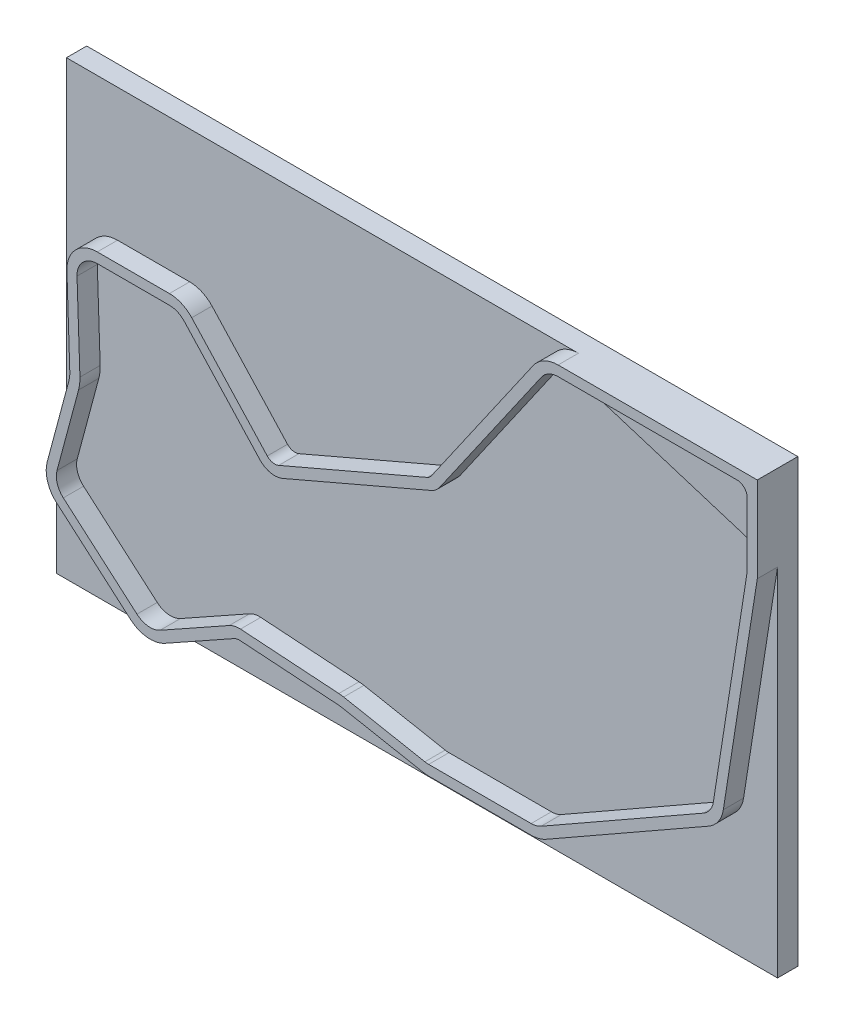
from build123d import *

# Parameters (mm, degrees)
EXTRUDE1_DEPTH = 12.7
FILLET1_R      = 19.05
FILLET2_R      = 6.35
EXTRUDE2_DEPTH = 389.615788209
SKETCH3_W      = 445.721828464
SKETCH3_H      = 276.707189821
EXTRUDE3_DEPTH = 12.7
EXTRUDE4_DEPTH = 6.35
FILLET3_R      = 12.7
EXTRUDE5_DEPTH = 6.35
FILLET4_R      = 6.35


with BuildPart() as part:
    # Sketch1 → Extrude1 (new body)
    with BuildSketch(Plane.XY):
        Polygon((-1.863502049, -35.485899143), (-58.4970628, -67.175824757), (-123.780352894, -10.586882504), (-106.4535941, 54.122304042), (-109.022054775, 130.579672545), (-35.768148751, 130.579672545), (20.270410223, 69.786878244), (119.063169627, 112.249961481), (189.565576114, 213.637337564), (324.37636912, 213.637337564), (324.37636912, 160.014136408), (301.678578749, 14.897116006), (187.653561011, -50.095146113), (116.604826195, -50.095146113), (62.806171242, -39.847783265), align=None)
    extrude(amount=-EXTRUDE1_DEPTH)

    # Fillet1
    fillet1_edges = [part.edges().sort_by_distance(p)[0] for p in [
        (-35.768148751, 130.579672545, -6.35),
        (189.565576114, 213.637337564, -6.35),
        (301.678578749, 14.897116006, -6.35),
        (187.653561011, -50.095146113, -6.35),
        (116.604826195, -50.095146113, -6.35),
        (62.806171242, -39.847783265, -6.35),
        (-58.4970628, -67.175824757, -6.35),
        (-123.780352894, -10.586882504, -6.35),
        (-106.4535941, 54.122304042, -6.35),
        (-109.022054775, 130.579672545, -6.35),
    ]]
    fillet(fillet1_edges, radius=FILLET1_R)

    # Fillet2
    fillet2_edges = [part.edges().sort_by_distance(p)[0] for p in [
        (20.270410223, 69.786878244, -6.35),
        (119.063169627, 112.249961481, -6.35),
        (-1.863502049, -35.485899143, -6.35),
    ]]
    fillet(fillet2_edges, radius=FILLET2_R)

    # Sketch2 → Extrude2 (cut, through all)
    with BuildSketch(Plane.XY):
        with BuildLine():
            Line((318.02636912, 207.287337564), (199.521744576, 207.287337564))
            ThreePointArc((199.521744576, 207.287337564), (193.639244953, 205.842833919), (189.094901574, 201.837919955))
            Line((189.094901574, 201.837919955), (125.313633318, 110.116009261))
            ThreePointArc((125.313633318, 110.116009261), (122.917439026, 107.527959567), (119.901868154, 105.698730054))
            Line((119.901868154, 105.698730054), (26.907780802, 65.728030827))
            ThreePointArc((26.907780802, 65.728030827), (19.244498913, 64.97506253), (12.554740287, 68.788195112))
            Line((12.554740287, 68.788195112), (-34.778727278, 120.137369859))
            ThreePointArc((-34.778727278, 120.137369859), (-39.019031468, 123.161692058), (-44.116689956, 124.229672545))
            Line((-44.116689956, 124.229672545), (-89.321355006, 124.229672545))
            ThreePointArc((-89.321355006, 124.229672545), (-98.451120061, 120.357888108), (-102.014194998, 111.103277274))
            Line((-102.014194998, 111.103277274), (-100.202271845, 57.16635018))
            ThreePointArc((-100.202271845, 57.16635018), (-100.352887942, 53.423654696), (-101.052297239, 49.743806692))
            Line((-101.052297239, 49.743806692), (-114.563286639, -0.714859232))
            ThreePointArc((-114.563286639, -0.714859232), (-114.437593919, -7.722445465), (-110.613924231, -13.596252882))
            Line((-110.613924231, -13.596252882), (-64.44510088, -53.616369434))
            ThreePointArc((-64.44510088, -53.616369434), (-57.419948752, -56.653827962), (-49.925078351, -55.102752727))
            Line((-49.925078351, -55.102752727), (-6.610381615, -30.865542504))
            ThreePointArc((-6.610381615, -30.865542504), (-3.197734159, -29.558447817), (0.445832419, -29.27723299))
            Line((0.445832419, -29.27723299), (62.083376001, -33.434603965))
            ThreePointArc((62.083376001, -33.434603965), (63.610953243, -33.584117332), (65.126710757, -33.825624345))
            Line((65.126710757, -33.825624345), (116.026623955, -43.520845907))
            ThreePointArc((116.026623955, -43.520845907), (117.209504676, -43.688946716), (118.402947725, -43.745146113))
            Line((118.402947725, -43.745146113), (182.605679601, -43.745146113))
            ThreePointArc((182.605679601, -43.745146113), (185.858667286, -43.321467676), (188.894612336, -42.07870062))
            Line((188.894612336, -42.07870062), (290.56399515, 15.871066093))
            ThreePointArc((290.56399515, 15.871066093), (294.728438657, 19.692344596), (296.822508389, 24.942071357))
            Line((296.822508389, 24.942071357), (318.02636912, 160.507738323))
            Line((318.02636912, 160.507738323), (318.02636912, 207.287337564))
        make_face()
    extrude(amount=-EXTRUDE2_DEPTH, mode=Mode.SUBTRACT)

    # Sketch3 → Extrude3 (add)
    with BuildSketch(Plane(origin=(0, 0, -12.7), x_dir=(-1, 0, 0), z_dir=(0, 0, -1))):
        with Locations((-101.515454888, 75.283742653)):
            Rectangle(SKETCH3_W, SKETCH3_H)
    extrude(amount=EXTRUDE3_DEPTH)

    # Sketch4 → Extrude4 (add)
    with BuildSketch(Plane.XY.offset(-12.7)):
        with BuildLine():
            Line((-68.604333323, -58.414628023), (-114.773156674, -18.394511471))
            ThreePointArc((-114.773156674, -18.394511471), (-119.624663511, -11.911826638), (-121.345459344, -3.999735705))
            Line((-121.345459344, -3.999735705), (-121.345459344, -63.069852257))
            Line((-121.345459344, -63.069852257), (-56.126635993, -63.069852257))
            ThreePointArc((-56.126635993, -63.069852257), (-62.78554062, -61.868143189), (-68.604333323, -58.414628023))
        make_face()
    extrude(amount=EXTRUDE4_DEPTH)

    # Fillet3
    fillet3_edges = [part.edges().sort_by_distance(p)[0] for p in [
        (318.02636912, 160.507738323, -6.35),
    ]]
    fillet(fillet3_edges, radius=FILLET3_R)

    # Sketch5 → Extrude5 (add)
    with BuildSketch(Plane.XY.offset(-12.7)):
        with BuildLine():
            Line((203.312806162, 206.708305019), (309.117430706, 173.615909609))
            ThreePointArc((309.117430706, 173.615909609), (315.559562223, 169.016362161), (318.02636912, 161.494942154))
            Line((318.02636912, 161.494942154), (318.02636912, 207.287337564))
            Line((318.02636912, 207.287337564), (199.521744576, 207.287337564))
            ThreePointArc((199.521744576, 207.287337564), (201.43925772, 207.141744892), (203.312806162, 206.708305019))
        make_face()
    extrude(amount=EXTRUDE5_DEPTH)

    # Fillet4
    fillet4_edges = [part.edges().sort_by_distance(p)[0] for p in [
        (318.02636912, 207.287337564, -3.175),
    ]]
    fillet(fillet4_edges, radius=FILLET4_R)


solid = part.part
